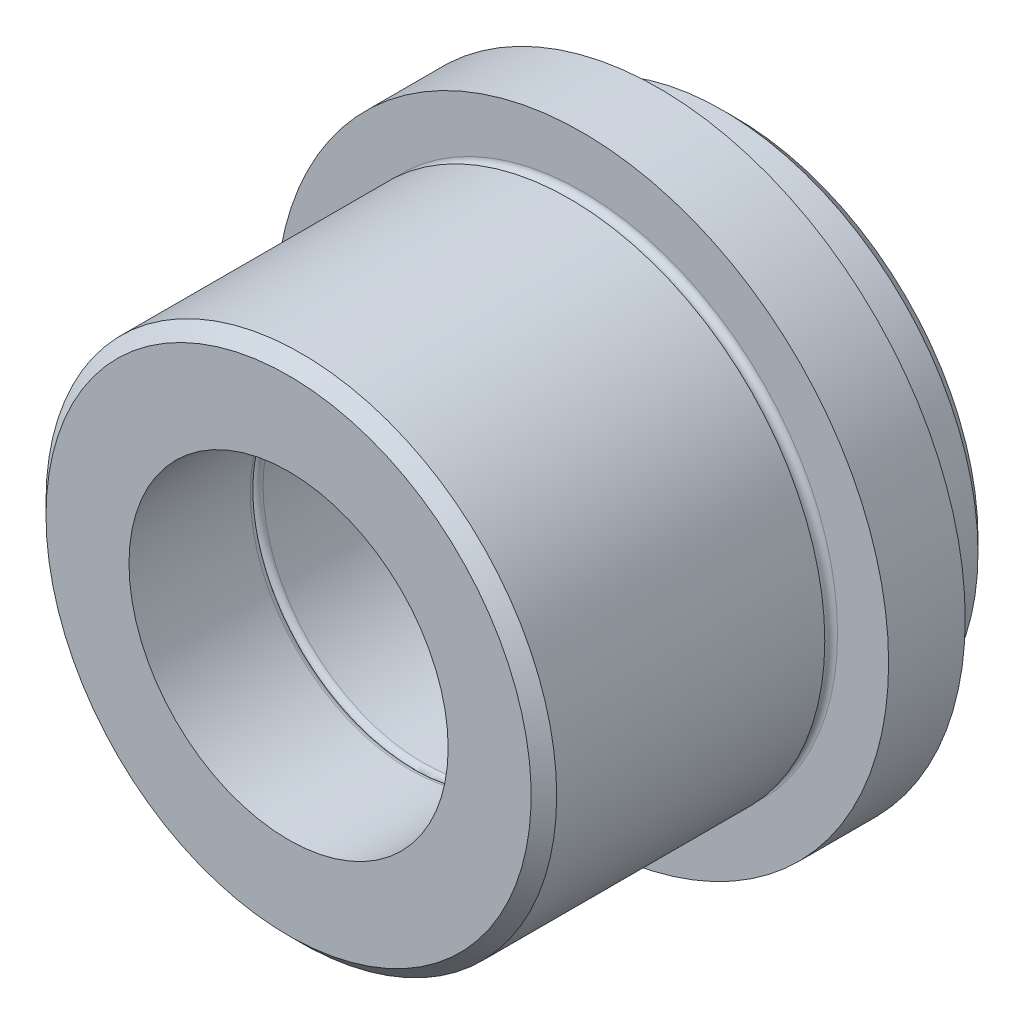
ISO-10303-21;
HEADER;
FILE_DESCRIPTION(('STEP AP214'),'2;1');
FILE_NAME('part.step','',(''),(''),'','','');
FILE_SCHEMA(('AUTOMOTIVE_DESIGN { 1 0 10303 214 1 1 1 1 }'));
ENDSEC;
DATA;
#1=APPLICATION_CONTEXT('core data for automotive mechanical design processes');
#2=APPLICATION_PROTOCOL_DEFINITION('international standard','automotive_design',2000,#1);
#3=PRODUCT_CONTEXT('',#1,'mechanical');
#4=PRODUCT('Part','Part','',(#3));
#5=PRODUCT_RELATED_PRODUCT_CATEGORY('part','',(#4));
#6=PRODUCT_DEFINITION_FORMATION('','',#4);
#7=PRODUCT_DEFINITION_CONTEXT('part definition',#1,'design');
#8=PRODUCT_DEFINITION('design','',#6,#7);
#9=PRODUCT_DEFINITION_SHAPE('','',#8);
#10=(LENGTH_UNIT() NAMED_UNIT(*) SI_UNIT(.MILLI.,.METRE.));
#11=(NAMED_UNIT(*) PLANE_ANGLE_UNIT() SI_UNIT($,.RADIAN.));
#12=(NAMED_UNIT(*) SI_UNIT($,.STERADIAN.) SOLID_ANGLE_UNIT());
#13=UNCERTAINTY_MEASURE_WITH_UNIT(LENGTH_MEASURE(1.E-05),#10,'distance_accuracy_value','');
#14=(GEOMETRIC_REPRESENTATION_CONTEXT(3) GLOBAL_UNCERTAINTY_ASSIGNED_CONTEXT((#13)) GLOBAL_UNIT_ASSIGNED_CONTEXT((#10,
#11,#12)) REPRESENTATION_CONTEXT('',''));
#15=CARTESIAN_POINT('',(0.,0.,0.));
#16=DIRECTION('',(0.,0.,1.));
#17=DIRECTION('',(1.,0.,0.));
#18=AXIS2_PLACEMENT_3D('',#15,#16,#17);
#19=CARTESIAN_POINT('',(0.,0.,0.));
#20=DIRECTION('',(0.,0.,1.));
#21=DIRECTION('',(1.,0.,0.));
#22=AXIS2_PLACEMENT_3D('',#19,#20,#21);
#23=CYLINDRICAL_SURFACE('',#22,12.5);
#24=CARTESIAN_POINT('',(0.,0.,-9.5));
#25=DIRECTION('',(0.,0.,1.));
#26=DIRECTION('',(1.,0.,0.));
#27=AXIS2_PLACEMENT_3D('',#24,#25,#26);
#28=CIRCLE('',#27,12.5);
#29=CARTESIAN_POINT('',(12.5,0.,-9.5));
#30=VERTEX_POINT('',#29);
#31=EDGE_CURVE('E69',#30,#30,#28,.T.);
#32=ORIENTED_EDGE('',*,*,#31,.F.);
#33=EDGE_LOOP('',(#32));
#34=FACE_BOUND('',#33,.T.);
#35=CARTESIAN_POINT('',(0.,0.,0.));
#36=DIRECTION('',(0.,0.,1.));
#37=DIRECTION('',(1.,0.,0.));
#38=AXIS2_PLACEMENT_3D('',#35,#36,#37);
#39=CIRCLE('',#38,12.5);
#40=CARTESIAN_POINT('',(12.5,0.,0.));
#41=VERTEX_POINT('',#40);
#42=EDGE_CURVE('E33',#41,#41,#39,.T.);
#43=ORIENTED_EDGE('',*,*,#42,.T.);
#44=EDGE_LOOP('',(#43));
#45=FACE_BOUND('',#44,.T.);
#46=ADVANCED_FACE('F13',(#34,#45),#23,.F.);
#47=CARTESIAN_POINT('',(0.,12.5,0.));
#48=DIRECTION('',(0.,0.,-1.));
#49=DIRECTION('',(-1.,0.,0.));
#50=AXIS2_PLACEMENT_3D('',#47,#48,#49);
#51=PLANE('',#50);
#52=CARTESIAN_POINT('',(0.,0.,0.));
#53=DIRECTION('',(0.,0.,-1.));
#54=DIRECTION('',(-1.,0.,0.));
#55=AXIS2_PLACEMENT_3D('',#52,#53,#54);
#56=CIRCLE('',#55,19.);
#57=CARTESIAN_POINT('',(-19.,0.,0.));
#58=VERTEX_POINT('',#57);
#59=EDGE_CURVE('E20',#58,#58,#56,.F.);
#60=ORIENTED_EDGE('',*,*,#59,.T.);
#61=EDGE_LOOP('',(#60));
#62=FACE_BOUND('',#61,.T.);
#63=ORIENTED_EDGE('',*,*,#42,.F.);
#64=EDGE_LOOP('',(#63));
#65=FACE_BOUND('',#64,.T.);
#66=ADVANCED_FACE('F77',(#62,#65),#51,.F.);
#67=CARTESIAN_POINT('',(0.,0.,0.));
#68=DIRECTION('',(0.,0.,1.));
#69=DIRECTION('',(1.,0.,0.));
#70=AXIS2_PLACEMENT_3D('',#67,#68,#69);
#71=CYLINDRICAL_SURFACE('',#70,20.);
#72=CARTESIAN_POINT('',(0.,0.,-1.00000000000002));
#73=DIRECTION('',(0.,0.,-1.));
#74=DIRECTION('',(-1.,0.,0.));
#75=AXIS2_PLACEMENT_3D('',#72,#73,#74);
#76=CIRCLE('',#75,20.);
#77=CARTESIAN_POINT('',(-20.,0.,-1.00000000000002));
#78=VERTEX_POINT('',#77);
#79=EDGE_CURVE('E8',#78,#78,#76,.T.);
#80=ORIENTED_EDGE('',*,*,#79,.T.);
#81=EDGE_LOOP('',(#80));
#82=FACE_BOUND('',#81,.T.);
#83=CARTESIAN_POINT('',(0.,0.,-22.));
#84=DIRECTION('',(0.,0.,1.));
#85=DIRECTION('',(1.,0.,0.));
#86=AXIS2_PLACEMENT_3D('',#83,#84,#85);
#87=CIRCLE('',#86,20.);
#88=CARTESIAN_POINT('',(20.,0.,-22.));
#89=VERTEX_POINT('',#88);
#90=EDGE_CURVE('E36',#89,#89,#87,.T.);
#91=ORIENTED_EDGE('',*,*,#90,.T.);
#92=EDGE_LOOP('',(#91));
#93=FACE_BOUND('',#92,.T.);
#94=ADVANCED_FACE('F82',(#82,#93),#71,.T.);
#95=CARTESIAN_POINT('',(0.,0.,-22.5));
#96=DIRECTION('',(0.,0.,1.));
#97=DIRECTION('',(1.,0.,0.));
#98=AXIS2_PLACEMENT_3D('',#95,#96,#97);
#99=TOROIDAL_SURFACE('',#98,20.,0.5);
#100=ORIENTED_EDGE('',*,*,#90,.F.);
#101=EDGE_LOOP('',(#100));
#102=FACE_BOUND('',#101,.T.);
#103=CARTESIAN_POINT('',(0.,0.,-23.));
#104=DIRECTION('',(0.,0.,1.));
#105=DIRECTION('',(1.,0.,0.));
#106=AXIS2_PLACEMENT_3D('',#103,#104,#105);
#107=CIRCLE('',#106,20.);
#108=CARTESIAN_POINT('',(20.,0.,-23.));
#109=VERTEX_POINT('',#108);
#110=EDGE_CURVE('E39',#109,#109,#107,.T.);
#111=ORIENTED_EDGE('',*,*,#110,.T.);
#112=EDGE_LOOP('',(#111));
#113=FACE_BOUND('',#112,.T.);
#114=ADVANCED_FACE('F89',(#102,#113),#99,.F.);
#115=CARTESIAN_POINT('',(0.,20.,-23.));
#116=DIRECTION('',(0.,0.,-1.));
#117=DIRECTION('',(-1.,0.,0.));
#118=AXIS2_PLACEMENT_3D('',#115,#116,#117);
#119=PLANE('',#118);
#120=ORIENTED_EDGE('',*,*,#110,.F.);
#121=EDGE_LOOP('',(#120));
#122=FACE_BOUND('',#121,.T.);
#123=CARTESIAN_POINT('',(0.,0.,-23.));
#124=DIRECTION('',(0.,0.,1.));
#125=DIRECTION('',(1.,0.,0.));
#126=AXIS2_PLACEMENT_3D('',#123,#124,#125);
#127=CIRCLE('',#126,24.);
#128=CARTESIAN_POINT('',(24.,0.,-23.));
#129=VERTEX_POINT('',#128);
#130=EDGE_CURVE('E42',#129,#129,#127,.T.);
#131=ORIENTED_EDGE('',*,*,#130,.T.);
#132=EDGE_LOOP('',(#131));
#133=FACE_BOUND('',#132,.T.);
#134=ADVANCED_FACE('F124',(#122,#133),#119,.F.);
#135=CARTESIAN_POINT('',(0.,0.,0.));
#136=DIRECTION('',(0.,0.,1.));
#137=DIRECTION('',(1.,0.,0.));
#138=AXIS2_PLACEMENT_3D('',#135,#136,#137);
#139=CYLINDRICAL_SURFACE('',#138,24.);
#140=ORIENTED_EDGE('',*,*,#130,.F.);
#141=EDGE_LOOP('',(#140));
#142=FACE_BOUND('',#141,.T.);
#143=CARTESIAN_POINT('',(0.,0.,-29.));
#144=DIRECTION('',(0.,0.,1.));
#145=DIRECTION('',(1.,0.,0.));
#146=AXIS2_PLACEMENT_3D('',#143,#144,#145);
#147=CIRCLE('',#146,24.);
#148=CARTESIAN_POINT('',(24.,0.,-29.));
#149=VERTEX_POINT('',#148);
#150=EDGE_CURVE('E45',#149,#149,#147,.T.);
#151=ORIENTED_EDGE('',*,*,#150,.T.);
#152=EDGE_LOOP('',(#151));
#153=FACE_BOUND('',#152,.T.);
#154=ADVANCED_FACE('F117',(#142,#153),#139,.T.);
#155=CARTESIAN_POINT('',(0.,24.,-29.));
#156=DIRECTION('',(0.,0.,1.));
#157=DIRECTION('',(1.,0.,0.));
#158=AXIS2_PLACEMENT_3D('',#155,#156,#157);
#159=PLANE('',#158);
#160=ORIENTED_EDGE('',*,*,#150,.F.);
#161=EDGE_LOOP('',(#160));
#162=FACE_BOUND('',#161,.T.);
#163=CARTESIAN_POINT('',(0.,0.,-29.));
#164=DIRECTION('',(0.,0.,1.));
#165=DIRECTION('',(1.,0.,0.));
#166=AXIS2_PLACEMENT_3D('',#163,#164,#165);
#167=CIRCLE('',#166,20.);
#168=CARTESIAN_POINT('',(20.,0.,-29.));
#169=VERTEX_POINT('',#168);
#170=EDGE_CURVE('E48',#169,#169,#167,.T.);
#171=ORIENTED_EDGE('',*,*,#170,.T.);
#172=EDGE_LOOP('',(#171));
#173=FACE_BOUND('',#172,.T.);
#174=ADVANCED_FACE('F112',(#162,#173),#159,.F.);
#175=CARTESIAN_POINT('',(0.,0.,0.));
#176=DIRECTION('',(0.,0.,1.));
#177=DIRECTION('',(1.,0.,0.));
#178=AXIS2_PLACEMENT_3D('',#175,#176,#177);
#179=CYLINDRICAL_SURFACE('',#178,20.);
#180=CARTESIAN_POINT('',(0.,0.,-34.));
#181=DIRECTION('',(0.,0.,1.));
#182=DIRECTION('',(1.,0.,0.));
#183=AXIS2_PLACEMENT_3D('',#180,#181,#182);
#184=CIRCLE('',#183,20.);
#185=CARTESIAN_POINT('',(20.,0.,-34.));
#186=VERTEX_POINT('',#185);
#187=EDGE_CURVE('E28',#186,#186,#184,.T.);
#188=ORIENTED_EDGE('',*,*,#187,.T.);
#189=EDGE_LOOP('',(#188));
#190=FACE_BOUND('',#189,.T.);
#191=ORIENTED_EDGE('',*,*,#170,.F.);
#192=EDGE_LOOP('',(#191));
#193=FACE_BOUND('',#192,.T.);
#194=ADVANCED_FACE('F108',(#190,#193),#179,.T.);
#195=CARTESIAN_POINT('',(0.,20.,-35.));
#196=DIRECTION('',(0.,0.,1.));
#197=DIRECTION('',(1.,0.,0.));
#198=AXIS2_PLACEMENT_3D('',#195,#196,#197);
#199=PLANE('',#198);
#200=CARTESIAN_POINT('',(0.,0.,-35.));
#201=DIRECTION('',(0.,0.,1.));
#202=DIRECTION('',(1.,0.,0.));
#203=AXIS2_PLACEMENT_3D('',#200,#201,#202);
#204=CIRCLE('',#203,19.);
#205=CARTESIAN_POINT('',(19.,0.,-35.));
#206=VERTEX_POINT('',#205);
#207=EDGE_CURVE('E24',#206,#206,#204,.F.);
#208=ORIENTED_EDGE('',*,*,#207,.T.);
#209=EDGE_LOOP('',(#208));
#210=FACE_BOUND('',#209,.T.);
#211=CARTESIAN_POINT('',(0.,0.,-35.));
#212=DIRECTION('',(0.,0.,1.));
#213=DIRECTION('',(1.,0.,0.));
#214=AXIS2_PLACEMENT_3D('',#211,#212,#213);
#215=CIRCLE('',#214,12.5);
#216=CARTESIAN_POINT('',(12.5,0.,-35.));
#217=VERTEX_POINT('',#216);
#218=EDGE_CURVE('E51',#217,#217,#215,.T.);
#219=ORIENTED_EDGE('',*,*,#218,.T.);
#220=EDGE_LOOP('',(#219));
#221=FACE_BOUND('',#220,.T.);
#222=ADVANCED_FACE('F111',(#210,#221),#199,.F.);
#223=CARTESIAN_POINT('',(0.,0.,0.));
#224=DIRECTION('',(0.,0.,1.));
#225=DIRECTION('',(1.,0.,0.));
#226=AXIS2_PLACEMENT_3D('',#223,#224,#225);
#227=CYLINDRICAL_SURFACE('',#226,12.5);
#228=ORIENTED_EDGE('',*,*,#218,.F.);
#229=EDGE_LOOP('',(#228));
#230=FACE_BOUND('',#229,.T.);
#231=CARTESIAN_POINT('',(0.,0.,-22.5));
#232=DIRECTION('',(0.,0.,1.));
#233=DIRECTION('',(1.,0.,0.));
#234=AXIS2_PLACEMENT_3D('',#231,#232,#233);
#235=CIRCLE('',#234,12.5);
#236=CARTESIAN_POINT('',(12.5,0.,-22.5));
#237=VERTEX_POINT('',#236);
#238=EDGE_CURVE('E54',#237,#237,#235,.T.);
#239=ORIENTED_EDGE('',*,*,#238,.T.);
#240=EDGE_LOOP('',(#239));
#241=FACE_BOUND('',#240,.T.);
#242=ADVANCED_FACE('F240',(#230,#241),#227,.F.);
#243=CARTESIAN_POINT('',(0.,0.,-22.5));
#244=DIRECTION('',(0.,0.,1.));
#245=DIRECTION('',(1.,0.,0.));
#246=AXIS2_PLACEMENT_3D('',#243,#244,#245);
#247=TOROIDAL_SURFACE('',#246,13.,0.5);
#248=ORIENTED_EDGE('',*,*,#238,.F.);
#249=EDGE_LOOP('',(#248));
#250=FACE_BOUND('',#249,.T.);
#251=CARTESIAN_POINT('',(0.,0.,-22.));
#252=DIRECTION('',(0.,0.,1.));
#253=DIRECTION('',(1.,0.,0.));
#254=AXIS2_PLACEMENT_3D('',#251,#252,#253);
#255=CIRCLE('',#254,13.);
#256=CARTESIAN_POINT('',(13.,0.,-22.));
#257=VERTEX_POINT('',#256);
#258=EDGE_CURVE('E57',#257,#257,#255,.T.);
#259=ORIENTED_EDGE('',*,*,#258,.T.);
#260=EDGE_LOOP('',(#259));
#261=FACE_BOUND('',#260,.T.);
#262=ADVANCED_FACE('F231',(#250,#261),#247,.T.);
#263=CARTESIAN_POINT('',(0.,0.,-21.5));
#264=DIRECTION('',(0.,0.,1.));
#265=DIRECTION('',(1.,0.,0.));
#266=AXIS2_PLACEMENT_3D('',#263,#264,#265);
#267=TOROIDAL_SURFACE('',#266,13.,0.5);
#268=ORIENTED_EDGE('',*,*,#258,.F.);
#269=EDGE_LOOP('',(#268));
#270=FACE_BOUND('',#269,.T.);
#271=CARTESIAN_POINT('',(0.,0.,-21.5));
#272=DIRECTION('',(0.,0.,1.));
#273=DIRECTION('',(1.,0.,0.));
#274=AXIS2_PLACEMENT_3D('',#271,#272,#273);
#275=CIRCLE('',#274,12.5);
#276=CARTESIAN_POINT('',(12.5,0.,-21.5));
#277=VERTEX_POINT('',#276);
#278=EDGE_CURVE('E60',#277,#277,#275,.T.);
#279=ORIENTED_EDGE('',*,*,#278,.T.);
#280=EDGE_LOOP('',(#279));
#281=FACE_BOUND('',#280,.T.);
#282=ADVANCED_FACE('F222',(#270,#281),#267,.T.);
#283=CARTESIAN_POINT('',(0.,0.,0.));
#284=DIRECTION('',(0.,0.,1.));
#285=DIRECTION('',(1.,0.,0.));
#286=AXIS2_PLACEMENT_3D('',#283,#284,#285);
#287=CYLINDRICAL_SURFACE('',#286,12.5);
#288=ORIENTED_EDGE('',*,*,#278,.F.);
#289=EDGE_LOOP('',(#288));
#290=FACE_BOUND('',#289,.T.);
#291=CARTESIAN_POINT('',(0.,0.,-10.5));
#292=DIRECTION('',(0.,0.,1.));
#293=DIRECTION('',(1.,0.,0.));
#294=AXIS2_PLACEMENT_3D('',#291,#292,#293);
#295=CIRCLE('',#294,12.5);
#296=CARTESIAN_POINT('',(12.5,0.,-10.5));
#297=VERTEX_POINT('',#296);
#298=EDGE_CURVE('E63',#297,#297,#295,.T.);
#299=ORIENTED_EDGE('',*,*,#298,.T.);
#300=EDGE_LOOP('',(#299));
#301=FACE_BOUND('',#300,.T.);
#302=ADVANCED_FACE('F214',(#290,#301),#287,.F.);
#303=CARTESIAN_POINT('',(0.,0.,-10.5));
#304=DIRECTION('',(0.,0.,1.));
#305=DIRECTION('',(1.,0.,0.));
#306=AXIS2_PLACEMENT_3D('',#303,#304,#305);
#307=TOROIDAL_SURFACE('',#306,13.,0.5);
#308=ORIENTED_EDGE('',*,*,#298,.F.);
#309=EDGE_LOOP('',(#308));
#310=FACE_BOUND('',#309,.T.);
#311=CARTESIAN_POINT('',(0.,0.,-10.));
#312=DIRECTION('',(0.,0.,1.));
#313=DIRECTION('',(1.,0.,0.));
#314=AXIS2_PLACEMENT_3D('',#311,#312,#313);
#315=CIRCLE('',#314,13.);
#316=CARTESIAN_POINT('',(13.,0.,-10.));
#317=VERTEX_POINT('',#316);
#318=EDGE_CURVE('E66',#317,#317,#315,.T.);
#319=ORIENTED_EDGE('',*,*,#318,.T.);
#320=EDGE_LOOP('',(#319));
#321=FACE_BOUND('',#320,.T.);
#322=ADVANCED_FACE('F101',(#310,#321),#307,.T.);
#323=CARTESIAN_POINT('',(0.,0.,-9.5));
#324=DIRECTION('',(0.,0.,1.));
#325=DIRECTION('',(1.,0.,0.));
#326=AXIS2_PLACEMENT_3D('',#323,#324,#325);
#327=TOROIDAL_SURFACE('',#326,13.,0.5);
#328=ORIENTED_EDGE('',*,*,#318,.F.);
#329=EDGE_LOOP('',(#328));
#330=FACE_BOUND('',#329,.T.);
#331=ORIENTED_EDGE('',*,*,#31,.T.);
#332=EDGE_LOOP('',(#331));
#333=FACE_BOUND('',#332,.T.);
#334=ADVANCED_FACE('F73',(#330,#333),#327,.T.);
#335=CARTESIAN_POINT('',(0.,0.,-34.));
#336=DIRECTION('',(0.,0.,1.));
#337=DIRECTION('',(1.,0.,0.));
#338=AXIS2_PLACEMENT_3D('',#335,#336,#337);
#339=CONICAL_SURFACE('',#338,20.,0.785398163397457);
#340=ORIENTED_EDGE('',*,*,#207,.F.);
#341=EDGE_LOOP('',(#340));
#342=FACE_BOUND('',#341,.T.);
#343=ORIENTED_EDGE('',*,*,#187,.F.);
#344=EDGE_LOOP('',(#343));
#345=FACE_BOUND('',#344,.T.);
#346=ADVANCED_FACE('F92',(#342,#345),#339,.T.);
#347=CARTESIAN_POINT('',(0.,0.,0.));
#348=DIRECTION('',(0.,0.,-1.));
#349=DIRECTION('',(-1.,0.,0.));
#350=AXIS2_PLACEMENT_3D('',#347,#348,#349);
#351=CONICAL_SURFACE('',#350,19.,0.785398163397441);
#352=ORIENTED_EDGE('',*,*,#79,.F.);
#353=EDGE_LOOP('',(#352));
#354=FACE_BOUND('',#353,.T.);
#355=ORIENTED_EDGE('',*,*,#59,.F.);
#356=EDGE_LOOP('',(#355));
#357=FACE_BOUND('',#356,.T.);
#358=ADVANCED_FACE('F15',(#354,#357),#351,.T.);
#359=CLOSED_SHELL('',(#46,#66,#94,#114,#134,#154,#174,#194,#222,#242,#262,#282,#302,#322,#334,
#346,#358));
#360=MANIFOLD_SOLID_BREP('B1',#359);
#361=ADVANCED_BREP_SHAPE_REPRESENTATION('',(#18,#360),#14);
#362=SHAPE_DEFINITION_REPRESENTATION(#9,#361);
ENDSEC;
END-ISO-10303-21;
